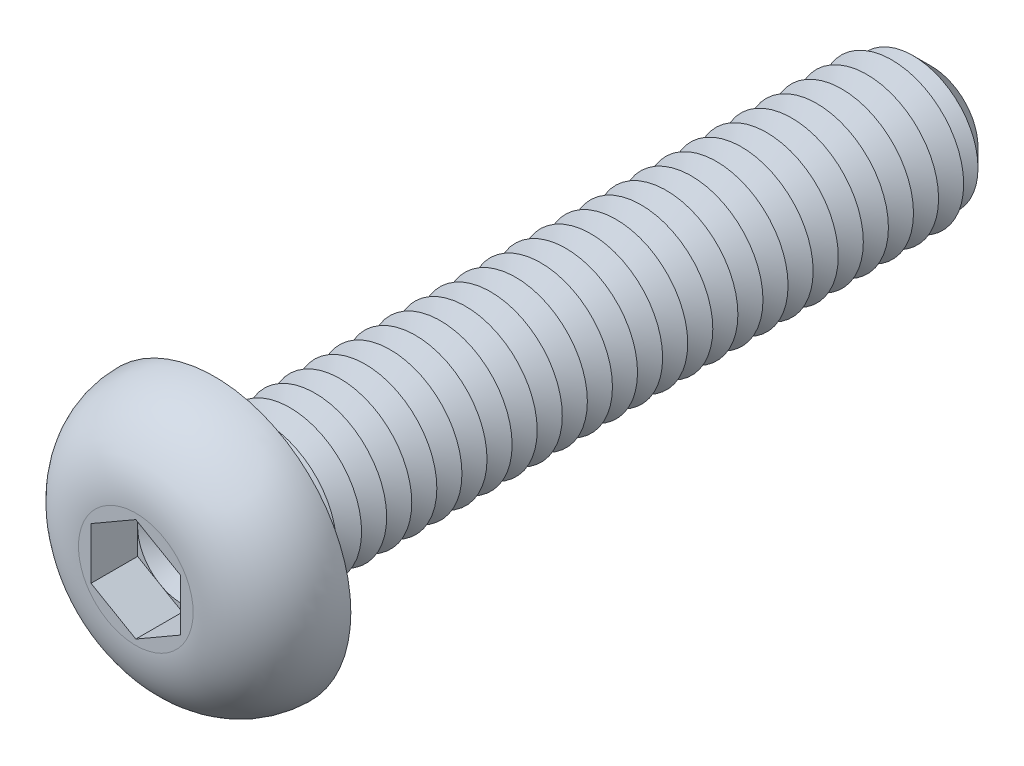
from build123d import *

# Parameters (mm, degrees)
CUT_EXTRUDE1_DEPTH  = 1.3
SKETCH4_R           = 2
BOSS_EXTRUDE1_DEPTH = 20
CHAMFER1_SIZE       = 0.7
LPATTERN1_COUNT     = 27
LPATTERN1_PITCH     = 0.7
FILLET2_R           = 0.3


with BuildPart() as part:
    # Sketch2 → Revolve1 (revolve)
    with BuildSketch(Plane(origin=(0, 0, 0), x_dir=(0, 0, -1), z_dir=(1, 0, 0)), mode=Mode.PRIVATE) as revolve1_sk:
        with BuildLine():
            Line((0, 0), (-2.2, 0))
            Line((-2.2, 0), (-2.2, 1.6))
            ThreePointArc((-2.2, 1.6), (-1.555634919, 3.155634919), (0, 3.8))
            Line((0, 3.8), (0, 0))
        make_face()
    revolve(revolve1_sk.sketch.rotate(Axis((0, 0, 47.934239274), (0, 0, -1)), 90), axis=Axis((0, 0, 47.934239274), (0, 0, -1)))

    # Sketch3 → Cut-Extrude1 (cut)
    with BuildSketch(Plane.XY.offset(2.2)):
        Polygon((0, 1.443375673), (-1.25, 0.721687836), (-1.25, -0.721687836), (0, -1.443375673), (1.25, -0.721687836), (1.25, 0.721687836), align=None)
    extrude(amount=-CUT_EXTRUDE1_DEPTH, mode=Mode.SUBTRACT)

    # Sketch4 → Boss-Extrude1 (add)
    with BuildSketch(Plane(origin=(0, 0, 0), x_dir=(-1, 0, 0), z_dir=(0, 0, -1))):
        with Locations(Location((0, 0, 0), (0, 0, 180))):
            Circle(SKETCH4_R)
    extrude(amount=BOSS_EXTRUDE1_DEPTH)

    # Chamfer1
    chamfer1_edges = [part.edges().sort_by_distance(p)[0] for p in [
        (-2, 0, -20),
    ]]
    chamfer(chamfer1_edges, length=CHAMFER1_SIZE)

    # Sketch5 → Cut-Revolve1 (revolve, cut)
    with BuildSketch(Plane(origin=(0, 0, 0), x_dir=(0, 0, -1), z_dir=(1, 0, 0)), mode=Mode.PRIVATE) as cut_revolve1_sk:
        Polygon((0.7, 2), (1.4, 2), (1.05, 1.393782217), align=None)
    cut_revolve1 = revolve(cut_revolve1_sk.sketch.rotate(Axis((0, 0, 47.934239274), (0, 0, -1)), 90), axis=Axis((0, 0, 47.934239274), (0, 0, -1)), mode=Mode.SUBTRACT)

    # LPattern1: Cut-Revolve1 ×27
    with Locations(*[(0, 0, -i * LPATTERN1_PITCH) for i in range(1, LPATTERN1_COUNT)]):
        add(cut_revolve1, mode=Mode.SUBTRACT)

    # Fillet2
    fillet2_edges = [part.edges().sort_by_distance(p)[0] for p in [
        (-2, 0, 0),
    ]]
    fillet(fillet2_edges, radius=FILLET2_R)

    # Cut-Extrude2 cone 1 section (on through the dimple's axis) → Cut-Extrude2 (revolve, cut)
    with BuildSketch(Plane(origin=(0, 0, 0.9), x_dir=(0, -1, 0), z_dir=(1, 0, 0))):
        Polygon((0, 0), (1.25, 0), (0, 0.721687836), align=None)
    revolve(axis=Axis((0, 0, 0.9), (0, 0, -1)), mode=Mode.SUBTRACT)


solid = part.part
